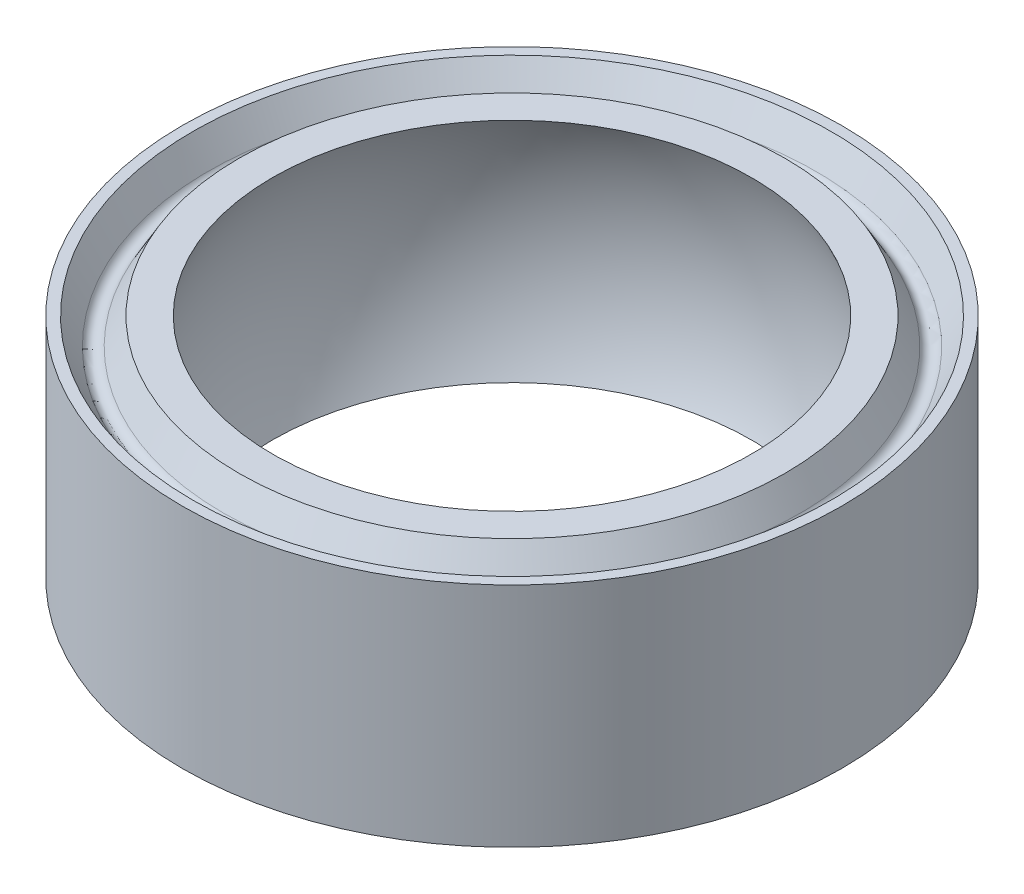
from build123d import *


with BuildPart() as part:
    # Sketch1 → Revolve1 (revolve)
    with BuildSketch(Plane.XY):
        with BuildLine():
            Line((-9.398, 3.2385), (-6.827357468, 3.2385))
            ThreePointArc((-6.827357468, 3.2385), (-7.5565, 0), (-6.827357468, -3.2385))
            Line((-6.827357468, -3.2385), (-9.398, -3.2385))
            Line((-9.398, -3.2385), (-9.398, 3.2385))
        make_face()
    revolve(axis=Axis((0, 32.890587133, 0), (0, -1, 0)))

    # Sketch2 → Staking Groove (revolve, cut)
    with BuildSketch(Plane.XY, mode=Mode.PRIVATE) as staking_groove_sk:
        with BuildLine():
            Line((-7.780494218, 3.2385), (-9.10031708, 3.2385))
            Line((-9.10031708, 3.2385), (-8.660376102, 2.476499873))
            ThreePointArc((-8.660376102, 2.476499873), (-8.440405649, 2.349499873), (-8.220435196, 2.476499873))
            Line((-8.220435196, 2.476499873), (-7.780494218, 3.2385))
        make_face()
    staking_groove = revolve(staking_groove_sk.sketch.rotate(Axis((0, 11.3988872, 0), (0, -1, 0)), 270), axis=Axis((0, 11.3988872, 0), (0, -1, 0)), mode=Mode.SUBTRACT)

    # Mirror Staking Groove: Staking Groove across plane
    add(staking_groove.mirror(Plane.ZX), mode=Mode.SUBTRACT)


solid = part.part
